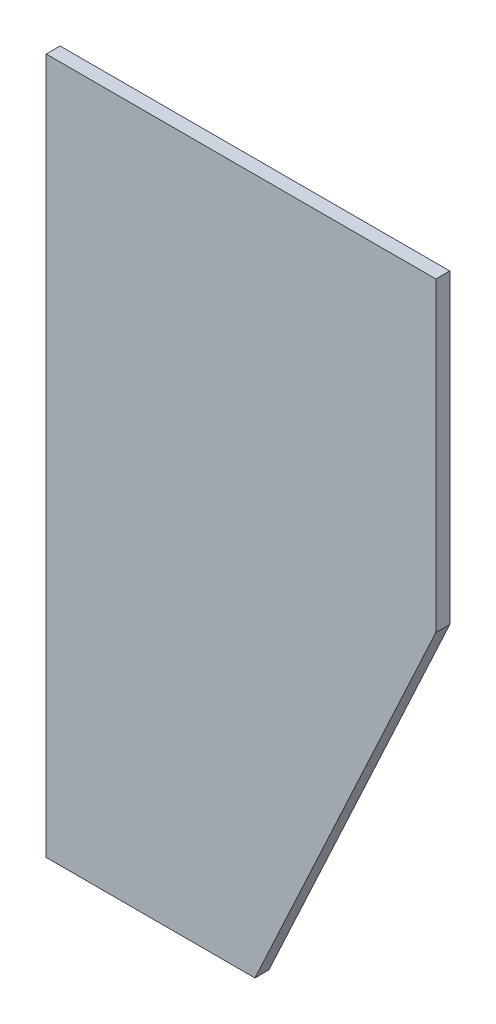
from build123d import *

# Parameters (mm, degrees)
BOSS_EXTRU_1_DEPTH = 10


with BuildPart() as part:
    # Esquisse1 → Boss.-Extru.1 (new body)
    with BuildSketch(Plane.XY):
        Polygon((0, 0), (0, 500), (280, 500), (280, 280), (150, 0), align=None)
    extrude(amount=BOSS_EXTRU_1_DEPTH)


solid = part.part
